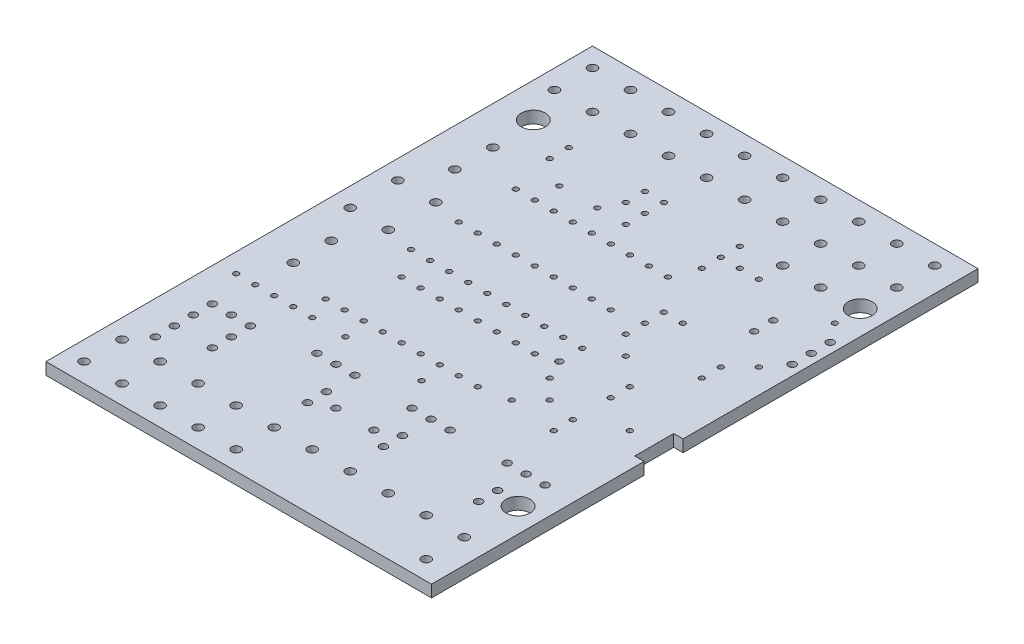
from build123d import *

# Parameters (mm, degrees)
ESQUISSE1_R        = 0.6
ESQUISSE1_R_2      = 0.5
ESQUISSE1_R_3      = 0.35
ESQUISSE1_R_4      = 0.45
ESQUISSE1_R_5      = 1.6
BOSS_EXTRU_1_DEPTH = 1.6


with BuildPart() as part:
    # Esquisse1 → Boss.-Extru.1 (new body)
    with BuildSketch(Plane(origin=(0, 0, 0), x_dir=(1, 0, 0), z_dir=(0, 1, 0))):
        Polygon((0, 0), (51.5, 0), (51.5, 28.4), (50.25, 28.4), (50.25, 33.6), (51.5, 33.6), (51.5, 73), (0, 73), align=None)
        with Locations(Location((2.54, 2.54, 0), (0, 0, 270))):
            Circle(ESQUISSE1_R, mode=Mode.SUBTRACT)
        with Locations(Location((2.54, 7.62, 0), (0, 0, 270))):
            Circle(ESQUISSE1_R, mode=Mode.SUBTRACT)
        with Locations(Location((7.62, 7.62, 0), (0, 0, 270))):
            Circle(ESQUISSE1_R, mode=Mode.SUBTRACT)
        with Locations(Location((7.62, 2.54, 0), (0, 0, 270))):
            Circle(ESQUISSE1_R, mode=Mode.SUBTRACT)
        with Locations(Location((12.7, 7.62, 0), (0, 0, 270))):
            Circle(ESQUISSE1_R, mode=Mode.SUBTRACT)
        with Locations(Location((12.7, 2.54, 0), (0, 0, 270))):
            Circle(ESQUISSE1_R, mode=Mode.SUBTRACT)
        with Locations(Location((17.78, 7.62, 0), (0, 0, 270))):
            Circle(ESQUISSE1_R, mode=Mode.SUBTRACT)
        with Locations(Location((17.78, 2.54, 0), (0, 0, 270))):
            Circle(ESQUISSE1_R, mode=Mode.SUBTRACT)
        with Locations(Location((22.86, 7.62, 0), (0, 0, 270))):
            Circle(ESQUISSE1_R, mode=Mode.SUBTRACT)
        with Locations(Location((22.86, 2.54, 0), (0, 0, 270))):
            Circle(ESQUISSE1_R, mode=Mode.SUBTRACT)
        with Locations(Location((27.94, 7.62, 0), (0, 0, 270))):
            Circle(ESQUISSE1_R, mode=Mode.SUBTRACT)
        with Locations(Location((4.44, 10.16, 0), (0, 0, 270))):
            Circle(ESQUISSE1_R_2, mode=Mode.SUBTRACT)
        with Locations(Location((33.02, 7.62, 0), (0, 0, 270))):
            Circle(ESQUISSE1_R, mode=Mode.SUBTRACT)
        with Locations(Location((4.44, 12.7, 0), (0, 0, 270))):
            Circle(ESQUISSE1_R_2, mode=Mode.SUBTRACT)
        with Locations(Location((38.1, 7.62, 0), (0, 0, 270))):
            Circle(ESQUISSE1_R, mode=Mode.SUBTRACT)
        with Locations(Location((4.44, 15.24, 0), (0, 0, 270))):
            Circle(ESQUISSE1_R_2, mode=Mode.SUBTRACT)
        with Locations(Location((43.18, 7.62, 0), (0, 0, 270))):
            Circle(ESQUISSE1_R, mode=Mode.SUBTRACT)
        with Locations(Location((43.18, 60.3, 0), (0, 0, 90))):
            Circle(ESQUISSE1_R, mode=Mode.SUBTRACT)
        with Locations(Location((48.26, 7.62, 0), (0, 0, 270))):
            Circle(ESQUISSE1_R, mode=Mode.SUBTRACT)
        with Locations(Location((48.26, 2.54, 0), (0, 0, 270))):
            Circle(ESQUISSE1_R, mode=Mode.SUBTRACT)
        with Locations(Location((48.26, 70.46, 0), (0, 0, 90))):
            Circle(ESQUISSE1_R, mode=Mode.SUBTRACT)
        with Locations(Location((48.26, 65.38, 0), (0, 0, 90))):
            Circle(ESQUISSE1_R, mode=Mode.SUBTRACT)
        with Locations(Location((43.18, 70.46, 0), (0, 0, 90))):
            Circle(ESQUISSE1_R, mode=Mode.SUBTRACT)
        with Locations(Location((43.18, 65.38, 0), (0, 0, 90))):
            Circle(ESQUISSE1_R, mode=Mode.SUBTRACT)
        with Locations(Location((38.1, 70.46, 0), (0, 0, 90))):
            Circle(ESQUISSE1_R, mode=Mode.SUBTRACT)
        with Locations(Location((38.1, 65.38, 0), (0, 0, 90))):
            Circle(ESQUISSE1_R, mode=Mode.SUBTRACT)
        with Locations(Location((33.02, 70.46, 0), (0, 0, 90))):
            Circle(ESQUISSE1_R, mode=Mode.SUBTRACT)
        with Locations(Location((33.02, 65.38, 0), (0, 0, 90))):
            Circle(ESQUISSE1_R, mode=Mode.SUBTRACT)
        with Locations(Location((27.94, 70.46, 0), (0, 0, 90))):
            Circle(ESQUISSE1_R, mode=Mode.SUBTRACT)
        with Locations(Location((27.94, 65.38, 0), (0, 0, 90))):
            Circle(ESQUISSE1_R, mode=Mode.SUBTRACT)
        with Locations(Location((22.86, 70.46, 0), (0, 0, 90))):
            Circle(ESQUISSE1_R, mode=Mode.SUBTRACT)
        with Locations(Location((22.86, 65.38, 0), (0, 0, 90))):
            Circle(ESQUISSE1_R, mode=Mode.SUBTRACT)
        with Locations(Location((17.78, 70.46, 0), (0, 0, 90))):
            Circle(ESQUISSE1_R, mode=Mode.SUBTRACT)
        with Locations(Location((17.78, 65.38, 0), (0, 0, 90))):
            Circle(ESQUISSE1_R, mode=Mode.SUBTRACT)
        with Locations(Location((12.7, 70.46, 0), (0, 0, 90))):
            Circle(ESQUISSE1_R, mode=Mode.SUBTRACT)
        with Locations(Location((12.7, 65.38, 0), (0, 0, 90))):
            Circle(ESQUISSE1_R, mode=Mode.SUBTRACT)
        with Locations(Location((7.62, 70.46, 0), (0, 0, 90))):
            Circle(ESQUISSE1_R, mode=Mode.SUBTRACT)
        with Locations(Location((7.62, 65.38, 0), (0, 0, 90))):
            Circle(ESQUISSE1_R, mode=Mode.SUBTRACT)
        with Locations(Location((2.54, 65.38, 0), (0, 0, 90))):
            Circle(ESQUISSE1_R, mode=Mode.SUBTRACT)
        with Locations(Location((2.54, 70.46, 0), (0, 0, 90))):
            Circle(ESQUISSE1_R, mode=Mode.SUBTRACT)
        with Locations(Location((38.1, 60.3, 0), (0, 0, 90))):
            Circle(ESQUISSE1_R, mode=Mode.SUBTRACT)
        with Locations(Location((4.44, 17.78, 0), (0, 0, 270))):
            Circle(ESQUISSE1_R_2, mode=Mode.SUBTRACT)
        with Locations(Location((22.22, 12.7, 0), (0, 0, 270))):
            Circle(ESQUISSE1_R_2, mode=Mode.SUBTRACT)
        with Locations(Location((22.22, 15.24, 0), (0, 0, 270))):
            Circle(ESQUISSE1_R_2, mode=Mode.SUBTRACT)
        with Locations(Location((6.98, 17.78, 0), (0, 0, 270))):
            Circle(ESQUISSE1_R_2, mode=Mode.SUBTRACT)
        with Locations(Location((9.52, 12.7, 0), (0, 0, 270))):
            Circle(ESQUISSE1_R_2, mode=Mode.SUBTRACT)
        with Locations(Location((9.52, 15.24, 0), (0, 0, 270))):
            Circle(ESQUISSE1_R_2, mode=Mode.SUBTRACT)
        with Locations(Location((9.52, 17.78, 0), (0, 0, 270))):
            Circle(ESQUISSE1_R_2, mode=Mode.SUBTRACT)
        with Locations(Location((32.38, 12.7, 0), (0, 0, 270))):
            Circle(ESQUISSE1_R_2, mode=Mode.SUBTRACT)
        with Locations(Location((32.38, 15.24, 0), (0, 0, 270))):
            Circle(ESQUISSE1_R_2, mode=Mode.SUBTRACT)
        with Locations(Location((45.08, 12.7, 0), (0, 0, 270))):
            Circle(ESQUISSE1_R_2, mode=Mode.SUBTRACT)
        with Locations(Location((45.08, 15.24, 0), (0, 0, 270))):
            Circle(ESQUISSE1_R_2, mode=Mode.SUBTRACT)
        with Locations(Location((22.22, 19.05, 0), (0, 0, 270))):
            Circle(ESQUISSE1_R_2, mode=Mode.SUBTRACT)
        with Locations(Location((32.38, 19.05, 0), (0, 0, 270))):
            Circle(ESQUISSE1_R_2, mode=Mode.SUBTRACT)
        with Locations(Location((45.08, 19.05, 0), (0, 0, 270))):
            Circle(ESQUISSE1_R_2, mode=Mode.SUBTRACT)
        with Locations(Location((47.62, 19.05, 0), (0, 0, 270))):
            Circle(ESQUISSE1_R_2, mode=Mode.SUBTRACT)
        with Locations(Location((34.92, 19.05, 0), (0, 0, 270))):
            Circle(ESQUISSE1_R_2, mode=Mode.SUBTRACT)
        with Locations(Location((42.54, 19.05, 0), (0, 0, 270))):
            Circle(ESQUISSE1_R_2, mode=Mode.SUBTRACT)
        with Locations(Location((29.84, 19.05, 0), (0, 0, 270))):
            Circle(ESQUISSE1_R_2, mode=Mode.SUBTRACT)
        with Locations(Location((19.68, 19.05, 0), (0, 0, 270))):
            Circle(ESQUISSE1_R_2, mode=Mode.SUBTRACT)
        with Locations(Location((2.54, 22.86, 0), (0, 0, 270))):
            Circle(ESQUISSE1_R_3, mode=Mode.SUBTRACT)
        with Locations(Location((5.08, 22.86, 0), (0, 0, 270))):
            Circle(ESQUISSE1_R_3, mode=Mode.SUBTRACT)
        with Locations(Location((17.14, 19.05, 0), (0, 0, 270))):
            Circle(ESQUISSE1_R_2, mode=Mode.SUBTRACT)
        with Locations(Location((7.62, 22.86, 0), (0, 0, 270))):
            Circle(ESQUISSE1_R_3, mode=Mode.SUBTRACT)
        with Locations(Location((10.16, 22.86, 0), (0, 0, 270))):
            Circle(ESQUISSE1_R_3, mode=Mode.SUBTRACT)
        with Locations(Location((12.7, 22.86, 0), (0, 0, 270))):
            Circle(ESQUISSE1_R_3, mode=Mode.SUBTRACT)
        with Locations(Location((17.14, 22.86, 0), (0, 0, 270))):
            Circle(ESQUISSE1_R_3, mode=Mode.SUBTRACT)
        with Locations(Location((13.97, 25.92, 0), (0, 0, 270))):
            Circle(ESQUISSE1_R_3, mode=Mode.SUBTRACT)
        with Locations(Location((13.97, 33.54, 0), (0, 0, 270))):
            Circle(ESQUISSE1_R_3, mode=Mode.SUBTRACT)
        with Locations(Location((13.97, 37.35, 0), (0, 0, 270))):
            Circle(ESQUISSE1_R_3, mode=Mode.SUBTRACT)
        with Locations(Location((13.97, 43.7, 0), (0, 0, 270))):
            Circle(ESQUISSE1_R_3, mode=Mode.SUBTRACT)
        with Locations(Location((13.97, 51.32, 0), (0, 0, 270))):
            Circle(ESQUISSE1_R_3, mode=Mode.SUBTRACT)
        with Locations(Location((11.43, 25.92, 0), (0, 0, 270))):
            Circle(ESQUISSE1_R_3, mode=Mode.SUBTRACT)
        with Locations(Location((35.56, 31.73, 0), (0, 0, 90))):
            Circle(ESQUISSE1_R_3, mode=Mode.SUBTRACT)
        with Locations(Location((11.43, 37.35, 0), (0, 0, 270))):
            Circle(ESQUISSE1_R_3, mode=Mode.SUBTRACT)
        with Locations(Location((11.43, 43.7, 0), (0, 0, 270))):
            Circle(ESQUISSE1_R_3, mode=Mode.SUBTRACT)
        with Locations(Location((11.43, 51.32, 0), (0, 0, 270))):
            Circle(ESQUISSE1_R_3, mode=Mode.SUBTRACT)
        with Locations(Location((16.51, 25.92, 0), (0, 0, 270))):
            Circle(ESQUISSE1_R_3, mode=Mode.SUBTRACT)
        with Locations(Location((16.51, 33.54, 0), (0, 0, 270))):
            Circle(ESQUISSE1_R_3, mode=Mode.SUBTRACT)
        with Locations(Location((16.51, 37.35, 0), (0, 0, 270))):
            Circle(ESQUISSE1_R_3, mode=Mode.SUBTRACT)
        with Locations(Location((16.51, 43.7, 0), (0, 0, 270))):
            Circle(ESQUISSE1_R_3, mode=Mode.SUBTRACT)
        with Locations(Location((16.51, 51.32, 0), (0, 0, 270))):
            Circle(ESQUISSE1_R_3, mode=Mode.SUBTRACT)
        with Locations(Location((19.05, 25.92, 0), (0, 0, 270))):
            Circle(ESQUISSE1_R_3, mode=Mode.SUBTRACT)
        with Locations(Location((19.05, 33.54, 0), (0, 0, 270))):
            Circle(ESQUISSE1_R_3, mode=Mode.SUBTRACT)
        with Locations(Location((19.05, 37.35, 0), (0, 0, 270))):
            Circle(ESQUISSE1_R_3, mode=Mode.SUBTRACT)
        with Locations(Location((19.05, 43.7, 0), (0, 0, 270))):
            Circle(ESQUISSE1_R_3, mode=Mode.SUBTRACT)
        with Locations(Location((19.05, 51.32, 0), (0, 0, 270))):
            Circle(ESQUISSE1_R_3, mode=Mode.SUBTRACT)
        with Locations(Location((21.59, 25.92, 0), (0, 0, 270))):
            Circle(ESQUISSE1_R_3, mode=Mode.SUBTRACT)
        with Locations(Location((21.59, 33.54, 0), (0, 0, 270))):
            Circle(ESQUISSE1_R_3, mode=Mode.SUBTRACT)
        with Locations(Location((21.59, 37.35, 0), (0, 0, 270))):
            Circle(ESQUISSE1_R_3, mode=Mode.SUBTRACT)
        with Locations(Location((21.59, 43.7, 0), (0, 0, 270))):
            Circle(ESQUISSE1_R_3, mode=Mode.SUBTRACT)
        with Locations(Location((21.59, 51.32, 0), (0, 0, 270))):
            Circle(ESQUISSE1_R_3, mode=Mode.SUBTRACT)
        with Locations(Location((24.13, 25.92, 0), (0, 0, 270))):
            Circle(ESQUISSE1_R_3, mode=Mode.SUBTRACT)
        with Locations(Location((24.13, 33.54, 0), (0, 0, 270))):
            Circle(ESQUISSE1_R_3, mode=Mode.SUBTRACT)
        with Locations(Location((24.13, 37.35, 0), (0, 0, 270))):
            Circle(ESQUISSE1_R_3, mode=Mode.SUBTRACT)
        with Locations(Location((24.13, 43.7, 0), (0, 0, 270))):
            Circle(ESQUISSE1_R_3, mode=Mode.SUBTRACT)
        with Locations(Location((24.13, 51.32, 0), (0, 0, 270))):
            Circle(ESQUISSE1_R_3, mode=Mode.SUBTRACT)
        with Locations(Location((26.67, 25.92, 0), (0, 0, 270))):
            Circle(ESQUISSE1_R_3, mode=Mode.SUBTRACT)
        with Locations(Location((26.67, 33.54, 0), (0, 0, 270))):
            Circle(ESQUISSE1_R_3, mode=Mode.SUBTRACT)
        with Locations(Location((26.67, 37.35, 0), (0, 0, 270))):
            Circle(ESQUISSE1_R_3, mode=Mode.SUBTRACT)
        with Locations(Location((26.67, 43.7, 0), (0, 0, 270))):
            Circle(ESQUISSE1_R_3, mode=Mode.SUBTRACT)
        with Locations(Location((26.67, 51.32, 0), (0, 0, 270))):
            Circle(ESQUISSE1_R_3, mode=Mode.SUBTRACT)
        with Locations(Location((29.21, 25.92, 0), (0, 0, 270))):
            Circle(ESQUISSE1_R_3, mode=Mode.SUBTRACT)
        with Locations(Location((29.21, 33.54, 0), (0, 0, 270))):
            Circle(ESQUISSE1_R_3, mode=Mode.SUBTRACT)
        with Locations(Location((29.21, 37.35, 0), (0, 0, 270))):
            Circle(ESQUISSE1_R_3, mode=Mode.SUBTRACT)
        with Locations(Location((29.21, 43.7, 0), (0, 0, 270))):
            Circle(ESQUISSE1_R_3, mode=Mode.SUBTRACT)
        with Locations(Location((29.21, 51.32, 0), (0, 0, 270))):
            Circle(ESQUISSE1_R_3, mode=Mode.SUBTRACT)
        with Locations(Location((31.75, 25.92, 0), (0, 0, 270))):
            Circle(ESQUISSE1_R_3, mode=Mode.SUBTRACT)
        with Locations(Location((31.75, 33.54, 0), (0, 0, 270))):
            Circle(ESQUISSE1_R_3, mode=Mode.SUBTRACT)
        with Locations(Location((31.75, 37.35, 0), (0, 0, 270))):
            Circle(ESQUISSE1_R_3, mode=Mode.SUBTRACT)
        with Locations(Location((31.75, 43.7, 0), (0, 0, 270))):
            Circle(ESQUISSE1_R_3, mode=Mode.SUBTRACT)
        with Locations(Location((31.75, 51.32, 0), (0, 0, 270))):
            Circle(ESQUISSE1_R_3, mode=Mode.SUBTRACT)
        with Locations(Location((35.56, 26.65, 0), (0, 0, 90))):
            Circle(ESQUISSE1_R_3, mode=Mode.SUBTRACT)
        with Locations(Location((41.91, 25.92, 0), (0, 0, 270))):
            Circle(ESQUISSE1_R_3, mode=Mode.SUBTRACT)
        with Locations(Location((34.29, 37.35, 0), (0, 0, 270))):
            Circle(ESQUISSE1_R_3, mode=Mode.SUBTRACT)
        with Locations(Location((34.29, 34.3, 0), (0, 0, 270))):
            Circle(ESQUISSE1_R_4, mode=Mode.SUBTRACT)
        with Locations(Location((5.08, 27.94, 0), (0, 0, 270))):
            Circle(ESQUISSE1_R, mode=Mode.SUBTRACT)
        with Locations(Location((41.91, 28.46, 0), (0, 0, 270))):
            Circle(ESQUISSE1_R_3, mode=Mode.SUBTRACT)
        with Locations(Location((38.1, 57.13, 0), (0, 0, 90))):
            Circle(ESQUISSE1_R_3, mode=Mode.SUBTRACT)
        with Locations(Location((38.1, 46.97, 0), (0, 0, 90))):
            Circle(ESQUISSE1_R_3, mode=Mode.SUBTRACT)
        with Locations(Location((5.08, 33.02, 0), (0, 0, 270))):
            Circle(ESQUISSE1_R, mode=Mode.SUBTRACT)
        with Locations(Location((41.91, 33.54, 0), (0, 0, 270))):
            Circle(ESQUISSE1_R_3, mode=Mode.SUBTRACT)
        with Locations(Location((41.91, 36.08, 0), (0, 0, 270))):
            Circle(ESQUISSE1_R_3, mode=Mode.SUBTRACT)
        with Locations(Location((46.99, 31, 0), (0, 0, 270))):
            Circle(ESQUISSE1_R_3, mode=Mode.SUBTRACT)
        with Locations(Location((29.84, 13.97, 0), (0, 0, 270))):
            Circle(ESQUISSE1_R_2, mode=Mode.SUBTRACT)
        with Locations(Location((24.76, 13.97, 0), (0, 0, 270))):
            Circle(ESQUISSE1_R_2, mode=Mode.SUBTRACT)
        with Locations(Location((5.08, 49.53, 0), (0, 0, 270))):
            Circle(ESQUISSE1_R, mode=Mode.SUBTRACT)
        with Locations(Location((5.08, 54.61, 0), (0, 0, 270))):
            Circle(ESQUISSE1_R, mode=Mode.SUBTRACT)
        with Locations(Location((2.54, 38.1, 0), (0, 0, 270))):
            Circle(ESQUISSE1_R, mode=Mode.SUBTRACT)
        with Locations(Location((7.62, 38.1, 0), (0, 0, 270))):
            Circle(ESQUISSE1_R, mode=Mode.SUBTRACT)
        with Locations(Location((7.62, 44.45, 0), (0, 0, 90))):
            Circle(ESQUISSE1_R, mode=Mode.SUBTRACT)
        with Locations(Location((2.54, 44.45, 0), (0, 0, 90))):
            Circle(ESQUISSE1_R, mode=Mode.SUBTRACT)
        with Locations(Location((35.56, 57.13, 0), (0, 0, 90))):
            Circle(ESQUISSE1_R_3, mode=Mode.SUBTRACT)
        with Locations(Location((33.02, 57.13, 0), (0, 0, 90))):
            Circle(ESQUISSE1_R_3, mode=Mode.SUBTRACT)
        with Locations(Location((33.02, 54.59, 0), (0, 0, 90))):
            Circle(ESQUISSE1_R_3, mode=Mode.SUBTRACT)
        with Locations(Location((33.02, 59.67, 0), (0, 0, 90))):
            Circle(ESQUISSE1_R_3, mode=Mode.SUBTRACT)
        with Locations(Location((22.86, 57.13, 0), (0, 0, 90))):
            Circle(ESQUISSE1_R_3, mode=Mode.SUBTRACT)
        with Locations(Location((22.86, 54.59, 0), (0, 0, 90))):
            Circle(ESQUISSE1_R_3, mode=Mode.SUBTRACT)
        with Locations(Location((22.86, 59.67, 0), (0, 0, 90))):
            Circle(ESQUISSE1_R_3, mode=Mode.SUBTRACT)
        with Locations(Location((20.32, 57.13, 0), (0, 0, 90))):
            Circle(ESQUISSE1_R_3, mode=Mode.SUBTRACT)
        with Locations(Location((20.32, 59.67, 0), (0, 0, 90))):
            Circle(ESQUISSE1_R_3, mode=Mode.SUBTRACT)
        with Locations(Location((10.16, 57.13, 0), (0, 0, 90))):
            Circle(ESQUISSE1_R_3, mode=Mode.SUBTRACT)
        with Locations(Location((10.16, 59.67, 0), (0, 0, 90))):
            Circle(ESQUISSE1_R_3, mode=Mode.SUBTRACT)
        with Locations(Location((19.05, 54.59, 0), (0, 0, 90))):
            Circle(ESQUISSE1_R_3, mode=Mode.SUBTRACT)
        with Locations(Location((27.3, 22.86, 0), (0, 0, 270))):
            Circle(ESQUISSE1_R_3, mode=Mode.SUBTRACT)
        with Locations(Location((13.97, 54.59, 0), (0, 0, 90))):
            Circle(ESQUISSE1_R_3, mode=Mode.SUBTRACT)
        with Locations(Location((38.1, 39.35, 0), (0, 0, 90))):
            Circle(ESQUISSE1_R_3, mode=Mode.SUBTRACT)
        with Locations(Location((38.1, 29.19, 0), (0, 0, 90))):
            Circle(ESQUISSE1_R_3, mode=Mode.SUBTRACT)
        with Locations(Location((35.56, 46.97, 0), (0, 0, 90))):
            Circle(ESQUISSE1_R_3, mode=Mode.SUBTRACT)
        with Locations(Location((35.56, 44.43, 0), (0, 0, 90))):
            Circle(ESQUISSE1_R_3, mode=Mode.SUBTRACT)
        with Locations(Location((35.56, 41.89, 0), (0, 0, 90))):
            Circle(ESQUISSE1_R_3, mode=Mode.SUBTRACT)
        with Locations(Location((45.72, 44.43, 0), (0, 0, 90))):
            Circle(ESQUISSE1_R_3, mode=Mode.SUBTRACT)
        with Locations(Location((45.72, 41.89, 0), (0, 0, 90))):
            Circle(ESQUISSE1_R_3, mode=Mode.SUBTRACT)
        with Locations(Location((48.26, 46.97, 0), (0, 0, 90))):
            Circle(ESQUISSE1_R_3, mode=Mode.SUBTRACT)
        with Locations(Location((48.26, 57.13, 0), (0, 0, 90))):
            Circle(ESQUISSE1_R_3, mode=Mode.SUBTRACT)
        with Locations(Location((48.26, 14.8, 0), (0, 0, 270))):
            Circle(ESQUISSE1_R_5, mode=Mode.SUBTRACT)
        with Locations(Location((50.16, 49.51, 0), (0, 0, 90))):
            Circle(ESQUISSE1_R_2, mode=Mode.SUBTRACT)
        with Locations(Location((50.16, 52.05, 0), (0, 0, 90))):
            Circle(ESQUISSE1_R_2, mode=Mode.SUBTRACT)
        with Locations(Location((50.16, 54.59, 0), (0, 0, 90))):
            Circle(ESQUISSE1_R_2, mode=Mode.SUBTRACT)
        with Locations(Location((43.81, 53.32, 0), (0, 0, 90))):
            Circle(ESQUISSE1_R_4, mode=Mode.SUBTRACT)
        with Locations(Location((48.26, 60.5, 0), (0, 0, 270))):
            Circle(ESQUISSE1_R_5, mode=Mode.SUBTRACT)
        with Locations(Location((43.81, 50.78, 0), (0, 0, 90))):
            Circle(ESQUISSE1_R_4, mode=Mode.SUBTRACT)
        with Locations(Location((4.6, 60.5, 0), (0, 0, 270))):
            Circle(ESQUISSE1_R_5, mode=Mode.SUBTRACT)
    extrude(amount=BOSS_EXTRU_1_DEPTH)


solid = part.part
